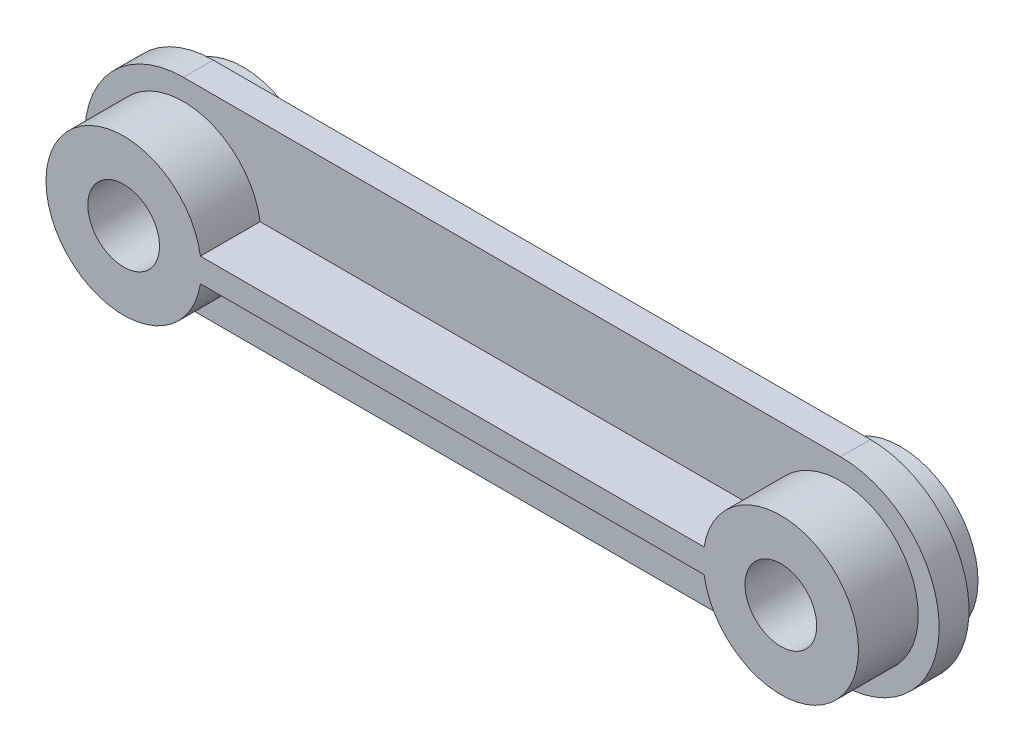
from build123d import *

# Parameters (mm, degrees)
EXTRUDE_1_DEPTH     = 10
EXTRUDE_2_DEPTH     = 20
EXTRUDE_START       = 10
SKETCH_3_R          = 26
EXTRUDE_3_DEPTH     = 10
SKETCH_4_R          = 12
CUT_EXTRUDE_1_DEPTH = 153.111800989


with BuildPart() as part:
    # Sketch 1 → Extrude 1 (new body)
    with BuildSketch(Plane.XY):
        with BuildLine():
            Line((-110, 33), (110, 33))
            ThreePointArc((110, 33), (143, 0), (110, -33))
            Line((110, -33), (-110, -33))
            ThreePointArc((-110, -33), (-143, 0), (-110, 33))
        make_face()
    extrude(amount=EXTRUDE_1_DEPTH)

    # Sketch 2 → Extrude 2 (add)
    with BuildSketch(Plane.XY.offset(10)):
        with BuildLine():
            Line((-84.309534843, 4), (84.309534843, 4))
            ThreePointArc((84.309534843, 4), (136, 0), (84.309534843, -4))
            Line((84.309534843, -4), (-84.309534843, -4))
            ThreePointArc((-84.309534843, -4), (-136, 0), (-84.309534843, 4))
        make_face()
    extrude(amount=EXTRUDE_2_DEPTH)

    # Sketch 3 → Extrude 3 (add)
    with BuildSketch(Plane(origin=(0, 0, 0), x_dir=(-1, 0, 0), z_dir=(0, 0, -1)).offset(EXTRUDE_START)):
        with Locations(Location((-110, 0, 0), (0, 0, 180))):
            Circle(SKETCH_3_R)
        with Locations(Location((110, 0, 0), (0, 0, 180))):
            Circle(SKETCH_3_R)
    extrude(amount=-EXTRUDE_3_DEPTH)

    # Sketch 4 → Cut-Extrude 1 (cut, through all)
    with BuildSketch(Plane(origin=(0, 0, -10), x_dir=(-1, 0, 0), z_dir=(0, 0, -1))):
        with Locations((-110, 0)):
            Circle(SKETCH_4_R)
        with Locations((110, 0)):
            Circle(SKETCH_4_R)
    extrude(amount=-CUT_EXTRUDE_1_DEPTH, mode=Mode.SUBTRACT)


solid = part.part
